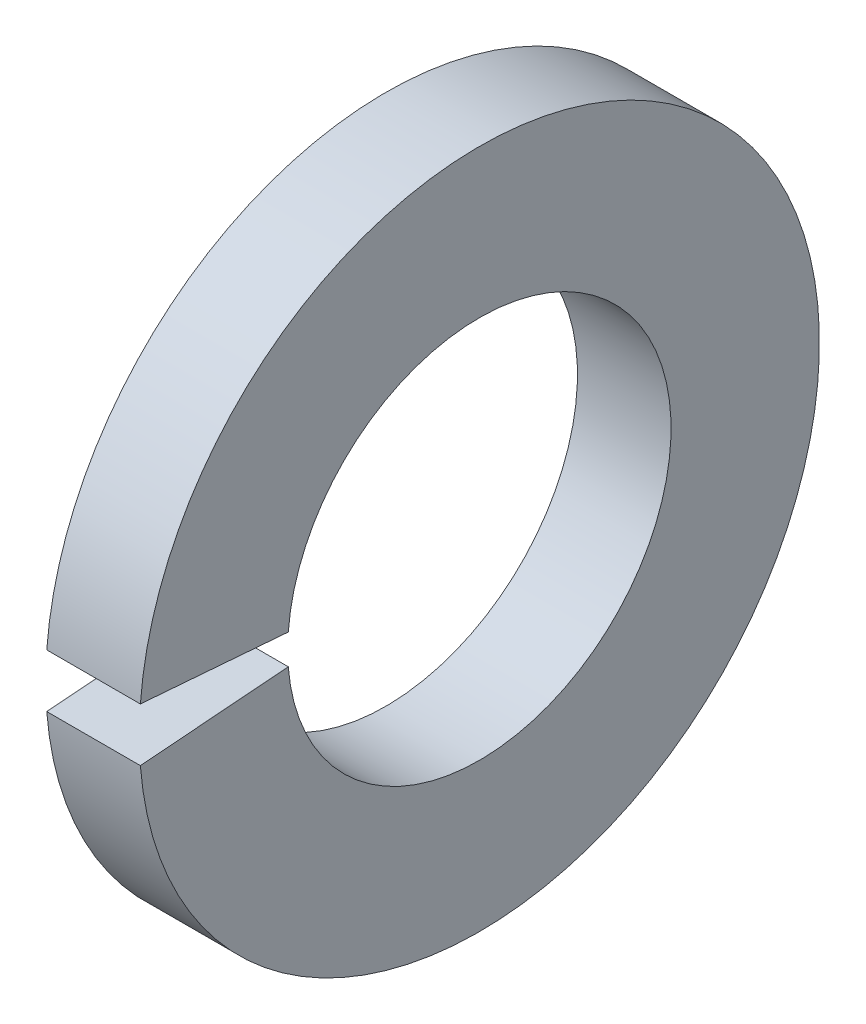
ISO-10303-21;
HEADER;
FILE_DESCRIPTION(('STEP AP214'),'2;1');
FILE_NAME('part.step','',(''),(''),'','','');
FILE_SCHEMA(('AUTOMOTIVE_DESIGN { 1 0 10303 214 1 1 1 1 }'));
ENDSEC;
DATA;
#1=APPLICATION_CONTEXT('core data for automotive mechanical design processes');
#2=APPLICATION_PROTOCOL_DEFINITION('international standard','automotive_design',2000,#1);
#3=PRODUCT_CONTEXT('',#1,'mechanical');
#4=PRODUCT('Part','Part','',(#3));
#5=PRODUCT_RELATED_PRODUCT_CATEGORY('part','',(#4));
#6=PRODUCT_DEFINITION_FORMATION('','',#4);
#7=PRODUCT_DEFINITION_CONTEXT('part definition',#1,'design');
#8=PRODUCT_DEFINITION('design','',#6,#7);
#9=PRODUCT_DEFINITION_SHAPE('','',#8);
#10=(LENGTH_UNIT() NAMED_UNIT(*) SI_UNIT(.MILLI.,.METRE.));
#11=(NAMED_UNIT(*) PLANE_ANGLE_UNIT() SI_UNIT($,.RADIAN.));
#12=(NAMED_UNIT(*) SI_UNIT($,.STERADIAN.) SOLID_ANGLE_UNIT());
#13=UNCERTAINTY_MEASURE_WITH_UNIT(LENGTH_MEASURE(1.E-05),#10,'distance_accuracy_value','');
#14=(GEOMETRIC_REPRESENTATION_CONTEXT(3) GLOBAL_UNCERTAINTY_ASSIGNED_CONTEXT((#13)) GLOBAL_UNIT_ASSIGNED_CONTEXT((#10,
#11,#12)) REPRESENTATION_CONTEXT('',''));
#15=CARTESIAN_POINT('',(0.,0.,0.));
#16=DIRECTION('',(0.,0.,1.));
#17=DIRECTION('',(1.,0.,0.));
#18=AXIS2_PLACEMENT_3D('',#15,#16,#17);
#19=CARTESIAN_POINT('',(-34.9249999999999,0.,0.));
#20=DIRECTION('',(-1.,0.,0.));
#21=DIRECTION('',(0.,0.,1.));
#22=AXIS2_PLACEMENT_3D('',#19,#20,#21);
#23=CYLINDRICAL_SURFACE('',#22,4.8895);
#24=CARTESIAN_POINT('',(0.,0.,0.));
#25=DIRECTION('',(-1.,0.,0.));
#26=DIRECTION('',(0.,0.,1.));
#27=AXIS2_PLACEMENT_3D('',#24,#25,#26);
#28=CIRCLE('',#27,4.8895);
#29=CARTESIAN_POINT('',(0.,0.383625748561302,4.87442730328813));
#30=VERTEX_POINT('',#29);
#31=CARTESIAN_POINT('',(0.,-0.383625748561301,4.87442730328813));
#32=VERTEX_POINT('',#31);
#33=EDGE_CURVE('E80',#30,#32,#28,.T.);
#34=ORIENTED_EDGE('',*,*,#33,.F.);
#35=DIRECTION('',(-1.,0.,0.));
#36=VECTOR('',#35,1.);
#37=CARTESIAN_POINT('',(-34.9249999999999,0.383625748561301,4.87442730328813));
#38=LINE('',#37,#36);
#39=CARTESIAN_POINT('',(-2.3876,0.383625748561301,4.87442730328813));
#40=VERTEX_POINT('',#39);
#41=EDGE_CURVE('E46',#30,#40,#38,.T.);
#42=ORIENTED_EDGE('',*,*,#41,.T.);
#43=CARTESIAN_POINT('',(-2.3876,0.,0.));
#44=DIRECTION('',(-1.,0.,0.));
#45=DIRECTION('',(0.,0.,1.));
#46=AXIS2_PLACEMENT_3D('',#43,#44,#45);
#47=CIRCLE('',#46,4.8895);
#48=CARTESIAN_POINT('',(-2.3876,-0.383625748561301,4.87442730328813));
#49=VERTEX_POINT('',#48);
#50=EDGE_CURVE('E76',#40,#49,#47,.T.);
#51=ORIENTED_EDGE('',*,*,#50,.T.);
#52=DIRECTION('',(-1.,0.,0.));
#53=VECTOR('',#52,1.);
#54=CARTESIAN_POINT('',(-34.9249999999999,-0.383625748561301,4.87442730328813));
#55=LINE('',#54,#53);
#56=EDGE_CURVE('E70',#32,#49,#55,.T.);
#57=ORIENTED_EDGE('',*,*,#56,.F.);
#58=EDGE_LOOP('',(#34,#42,#51,#57));
#59=FACE_BOUND('',#58,.T.);
#60=ADVANCED_FACE('F32',(#59),#23,.F.);
#61=CARTESIAN_POINT('',(-2.3876,8.6741,0.));
#62=DIRECTION('',(1.,0.,0.));
#63=DIRECTION('',(0.,0.,-1.));
#64=AXIS2_PLACEMENT_3D('',#61,#62,#63);
#65=PLANE('',#64);
#66=ORIENTED_EDGE('',*,*,#50,.F.);
#67=DIRECTION('',(0.,0.0784590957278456,0.996917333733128));
#68=VECTOR('',#67,1.);
#69=CARTESIAN_POINT('',(-2.3876,0.,0.));
#70=LINE('',#69,#68);
#71=CARTESIAN_POINT('',(-2.3876,0.680562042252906,8.64736064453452));
#72=VERTEX_POINT('',#71);
#73=EDGE_CURVE('E99',#40,#72,#70,.T.);
#74=ORIENTED_EDGE('',*,*,#73,.T.);
#75=CARTESIAN_POINT('',(-2.3876,0.,0.));
#76=DIRECTION('',(-1.,0.,0.));
#77=DIRECTION('',(0.,0.,1.));
#78=AXIS2_PLACEMENT_3D('',#75,#76,#77);
#79=CIRCLE('',#78,8.6741);
#80=CARTESIAN_POINT('',(-2.3876,-0.680562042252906,8.64736064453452));
#81=VERTEX_POINT('',#80);
#82=EDGE_CURVE('E87',#72,#81,#79,.T.);
#83=ORIENTED_EDGE('',*,*,#82,.T.);
#84=DIRECTION('',(0.,-0.0784590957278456,0.996917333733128));
#85=VECTOR('',#84,1.);
#86=CARTESIAN_POINT('',(-2.3876,0.,0.));
#87=LINE('',#86,#85);
#88=EDGE_CURVE('E98',#49,#81,#87,.T.);
#89=ORIENTED_EDGE('',*,*,#88,.F.);
#90=EDGE_LOOP('',(#66,#74,#83,#89));
#91=FACE_BOUND('',#90,.T.);
#92=ADVANCED_FACE('F97',(#91),#65,.F.);
#93=CARTESIAN_POINT('',(-34.9249999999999,0.,0.));
#94=DIRECTION('',(-1.,0.,0.));
#95=DIRECTION('',(0.,0.,1.));
#96=AXIS2_PLACEMENT_3D('',#93,#94,#95);
#97=CYLINDRICAL_SURFACE('',#96,8.6741);
#98=ORIENTED_EDGE('',*,*,#82,.F.);
#99=DIRECTION('',(-1.,0.,0.));
#100=VECTOR('',#99,1.);
#101=CARTESIAN_POINT('',(-34.9249999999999,0.680562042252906,8.64736064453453));
#102=LINE('',#101,#100);
#103=CARTESIAN_POINT('',(0.,0.680562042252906,8.64736064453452));
#104=VERTEX_POINT('',#103);
#105=EDGE_CURVE('E82',#72,#104,#102,.F.);
#106=ORIENTED_EDGE('',*,*,#105,.T.);
#107=CARTESIAN_POINT('',(0.,0.,0.));
#108=DIRECTION('',(-1.,0.,0.));
#109=DIRECTION('',(0.,0.,1.));
#110=AXIS2_PLACEMENT_3D('',#107,#108,#109);
#111=CIRCLE('',#110,8.6741);
#112=CARTESIAN_POINT('',(0.,-0.680562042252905,8.64736064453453));
#113=VERTEX_POINT('',#112);
#114=EDGE_CURVE('E85',#104,#113,#111,.T.);
#115=ORIENTED_EDGE('',*,*,#114,.T.);
#116=DIRECTION('',(-1.,0.,0.));
#117=VECTOR('',#116,1.);
#118=CARTESIAN_POINT('',(-34.9249999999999,-0.680562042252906,8.64736064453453));
#119=LINE('',#118,#117);
#120=EDGE_CURVE('E53',#81,#113,#119,.F.);
#121=ORIENTED_EDGE('',*,*,#120,.F.);
#122=EDGE_LOOP('',(#98,#106,#115,#121));
#123=FACE_BOUND('',#122,.T.);
#124=ADVANCED_FACE('F102',(#123),#97,.T.);
#125=CARTESIAN_POINT('',(0.,4.8895,0.));
#126=DIRECTION('',(-1.,0.,0.));
#127=DIRECTION('',(0.,0.,1.));
#128=AXIS2_PLACEMENT_3D('',#125,#126,#127);
#129=PLANE('',#128);
#130=ORIENTED_EDGE('',*,*,#114,.F.);
#131=DIRECTION('',(0.,-0.0784590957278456,-0.996917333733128));
#132=VECTOR('',#131,1.);
#133=CARTESIAN_POINT('',(0.,0.0300989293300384,0.382443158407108));
#134=LINE('',#133,#132);
#135=EDGE_CURVE('E11',#104,#30,#134,.T.);
#136=ORIENTED_EDGE('',*,*,#135,.T.);
#137=ORIENTED_EDGE('',*,*,#33,.T.);
#138=DIRECTION('',(0.,0.0784590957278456,-0.996917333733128));
#139=VECTOR('',#138,1.);
#140=CARTESIAN_POINT('',(0.,0.0300989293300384,-0.382443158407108));
#141=LINE('',#140,#139);
#142=EDGE_CURVE('E39',#113,#32,#141,.T.);
#143=ORIENTED_EDGE('',*,*,#142,.F.);
#144=EDGE_LOOP('',(#130,#136,#137,#143));
#145=FACE_BOUND('',#144,.T.);
#146=ADVANCED_FACE('F84',(#145),#129,.F.);
#147=CARTESIAN_POINT('',(-2.3876,0.,0.));
#148=DIRECTION('',(0.,0.996917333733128,0.0784590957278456));
#149=DIRECTION('',(0.,-0.0784590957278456,0.996917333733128));
#150=AXIS2_PLACEMENT_3D('',#147,#148,#149);
#151=PLANE('',#150);
#152=ORIENTED_EDGE('',*,*,#56,.T.);
#153=ORIENTED_EDGE('',*,*,#88,.T.);
#154=ORIENTED_EDGE('',*,*,#120,.T.);
#155=ORIENTED_EDGE('',*,*,#142,.T.);
#156=EDGE_LOOP('',(#152,#153,#154,#155));
#157=FACE_BOUND('',#156,.T.);
#158=ADVANCED_FACE('F69',(#157),#151,.T.);
#159=CARTESIAN_POINT('',(-2.3876,0.,0.));
#160=DIRECTION('',(0.,0.996917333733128,-0.0784590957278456));
#161=DIRECTION('',(0.,0.0784590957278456,0.996917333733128));
#162=AXIS2_PLACEMENT_3D('',#159,#160,#161);
#163=PLANE('',#162);
#164=ORIENTED_EDGE('',*,*,#135,.F.);
#165=ORIENTED_EDGE('',*,*,#105,.F.);
#166=ORIENTED_EDGE('',*,*,#73,.F.);
#167=ORIENTED_EDGE('',*,*,#41,.F.);
#168=EDGE_LOOP('',(#164,#165,#166,#167));
#169=FACE_BOUND('',#168,.T.);
#170=ADVANCED_FACE('F106',(#169),#163,.F.);
#171=CLOSED_SHELL('',(#60,#92,#124,#146,#158,#170));
#172=MANIFOLD_SOLID_BREP('B2',#171);
#173=ADVANCED_BREP_SHAPE_REPRESENTATION('',(#18,#172),#14);
#174=SHAPE_DEFINITION_REPRESENTATION(#9,#173);
ENDSEC;
END-ISO-10303-21;
